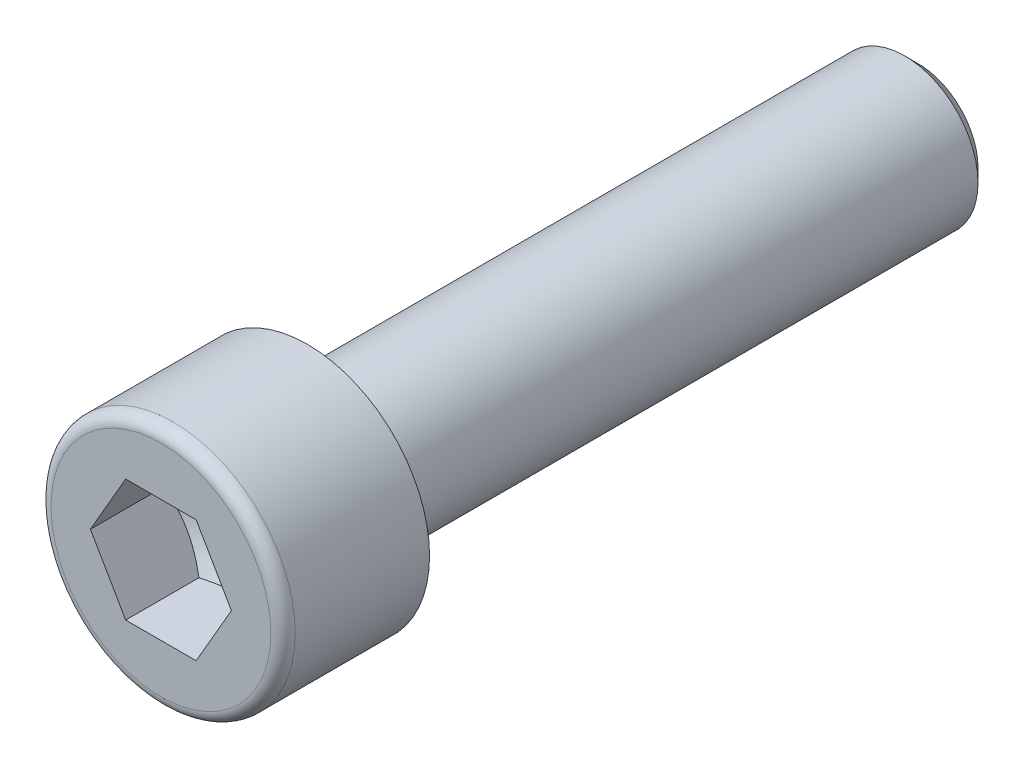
ISO-10303-21;
HEADER;
FILE_DESCRIPTION(('STEP AP214'),'2;1');
FILE_NAME('part.step','',(''),(''),'','','');
FILE_SCHEMA(('AUTOMOTIVE_DESIGN { 1 0 10303 214 1 1 1 1 }'));
ENDSEC;
DATA;
#1=APPLICATION_CONTEXT('core data for automotive mechanical design processes');
#2=APPLICATION_PROTOCOL_DEFINITION('international standard','automotive_design',2000,#1);
#3=PRODUCT_CONTEXT('',#1,'mechanical');
#4=PRODUCT('Part','Part','',(#3));
#5=PRODUCT_RELATED_PRODUCT_CATEGORY('part','',(#4));
#6=PRODUCT_DEFINITION_FORMATION('','',#4);
#7=PRODUCT_DEFINITION_CONTEXT('part definition',#1,'design');
#8=PRODUCT_DEFINITION('design','',#6,#7);
#9=PRODUCT_DEFINITION_SHAPE('','',#8);
#10=(LENGTH_UNIT() NAMED_UNIT(*) SI_UNIT(.MILLI.,.METRE.));
#11=(NAMED_UNIT(*) PLANE_ANGLE_UNIT() SI_UNIT($,.RADIAN.));
#12=(NAMED_UNIT(*) SI_UNIT($,.STERADIAN.) SOLID_ANGLE_UNIT());
#13=UNCERTAINTY_MEASURE_WITH_UNIT(LENGTH_MEASURE(1.E-05),#10,'distance_accuracy_value','');
#14=(GEOMETRIC_REPRESENTATION_CONTEXT(3) GLOBAL_UNCERTAINTY_ASSIGNED_CONTEXT((#13)) GLOBAL_UNIT_ASSIGNED_CONTEXT((#10,
#11,#12)) REPRESENTATION_CONTEXT('',''));
#15=CARTESIAN_POINT('',(0.,0.,0.));
#16=DIRECTION('',(0.,0.,1.));
#17=DIRECTION('',(1.,0.,0.));
#18=AXIS2_PLACEMENT_3D('',#15,#16,#17);
#19=CARTESIAN_POINT('',(0.,0.,6.));
#20=DIRECTION('',(0.,0.,1.));
#21=DIRECTION('',(1.,0.,0.));
#22=AXIS2_PLACEMENT_3D('',#19,#20,#21);
#23=PLANE('',#22);
#24=CARTESIAN_POINT('',(0.,0.,6.));
#25=DIRECTION('',(0.,0.,1.));
#26=DIRECTION('',(1.,0.,0.));
#27=AXIS2_PLACEMENT_3D('',#24,#25,#26);
#28=CIRCLE('',#27,4.5);
#29=CARTESIAN_POINT('',(4.5,0.,6.));
#30=VERTEX_POINT('',#29);
#31=EDGE_CURVE('E11',#30,#30,#28,.T.);
#32=ORIENTED_EDGE('',*,*,#31,.T.);
#33=EDGE_LOOP('',(#32));
#34=FACE_BOUND('',#33,.T.);
#35=DIRECTION('',(1.,0.,0.));
#36=VECTOR('',#35,1.);
#37=CARTESIAN_POINT('',(-1.443375,2.49999883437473,6.));
#38=LINE('',#37,#36);
#39=CARTESIAN_POINT('',(-1.443375,2.49999883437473,6.));
#40=VERTEX_POINT('',#39);
#41=CARTESIAN_POINT('',(1.443375,2.49999883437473,6.));
#42=VERTEX_POINT('',#41);
#43=EDGE_CURVE('E92',#40,#42,#38,.T.);
#44=ORIENTED_EDGE('',*,*,#43,.T.);
#45=DIRECTION('',(0.5,-0.866025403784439,0.));
#46=VECTOR('',#45,1.);
#47=CARTESIAN_POINT('',(1.443375,2.49999883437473,6.));
#48=LINE('',#47,#46);
#49=CARTESIAN_POINT('',(2.88675,0.,6.));
#50=VERTEX_POINT('',#49);
#51=EDGE_CURVE('E31',#42,#50,#48,.T.);
#52=ORIENTED_EDGE('',*,*,#51,.T.);
#53=DIRECTION('',(-0.5,-0.866025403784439,0.));
#54=VECTOR('',#53,1.);
#55=CARTESIAN_POINT('',(2.88675,0.,6.));
#56=LINE('',#55,#54);
#57=CARTESIAN_POINT('',(1.443375,-2.49999883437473,6.));
#58=VERTEX_POINT('',#57);
#59=EDGE_CURVE('E169',#50,#58,#56,.T.);
#60=ORIENTED_EDGE('',*,*,#59,.T.);
#61=DIRECTION('',(-1.,0.,0.));
#62=VECTOR('',#61,1.);
#63=CARTESIAN_POINT('',(1.443375,-2.49999883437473,6.));
#64=LINE('',#63,#62);
#65=CARTESIAN_POINT('',(-1.443375,-2.49999883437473,6.));
#66=VERTEX_POINT('',#65);
#67=EDGE_CURVE('E165',#58,#66,#64,.T.);
#68=ORIENTED_EDGE('',*,*,#67,.T.);
#69=DIRECTION('',(-0.5,0.866025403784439,0.));
#70=VECTOR('',#69,1.);
#71=CARTESIAN_POINT('',(-1.443375,-2.49999883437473,6.));
#72=LINE('',#71,#70);
#73=CARTESIAN_POINT('',(-2.88675,0.,6.));
#74=VERTEX_POINT('',#73);
#75=EDGE_CURVE('E160',#66,#74,#72,.T.);
#76=ORIENTED_EDGE('',*,*,#75,.T.);
#77=DIRECTION('',(0.5,0.866025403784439,0.));
#78=VECTOR('',#77,1.);
#79=CARTESIAN_POINT('',(-2.88675,0.,6.));
#80=LINE('',#79,#78);
#81=EDGE_CURVE('E96',#74,#40,#80,.T.);
#82=ORIENTED_EDGE('',*,*,#81,.T.);
#83=EDGE_LOOP('',(#44,#52,#60,#68,#76,#82));
#84=FACE_BOUND('',#83,.T.);
#85=ADVANCED_FACE('F17',(#34,#84),#23,.T.);
#86=CARTESIAN_POINT('',(0.,0.,5.5));
#87=DIRECTION('',(0.,0.,1.));
#88=DIRECTION('',(1.,0.,0.));
#89=AXIS2_PLACEMENT_3D('',#86,#87,#88);
#90=TOROIDAL_SURFACE('',#89,4.5,0.5);
#91=ORIENTED_EDGE('',*,*,#31,.F.);
#92=EDGE_LOOP('',(#91));
#93=FACE_BOUND('',#92,.T.);
#94=CARTESIAN_POINT('',(0.,0.,5.5));
#95=DIRECTION('',(0.,0.,1.));
#96=DIRECTION('',(1.,0.,0.));
#97=AXIS2_PLACEMENT_3D('',#94,#95,#96);
#98=CIRCLE('',#97,5.);
#99=CARTESIAN_POINT('',(5.,0.,5.5));
#100=VERTEX_POINT('',#99);
#101=EDGE_CURVE('E24',#100,#100,#98,.T.);
#102=ORIENTED_EDGE('',*,*,#101,.T.);
#103=EDGE_LOOP('',(#102));
#104=FACE_BOUND('',#103,.T.);
#105=ADVANCED_FACE('F133',(#93,#104),#90,.T.);
#106=CARTESIAN_POINT('',(0.,0.,6.));
#107=DIRECTION('',(0.,0.,1.));
#108=DIRECTION('',(1.,0.,0.));
#109=AXIS2_PLACEMENT_3D('',#106,#107,#108);
#110=CYLINDRICAL_SURFACE('',#109,5.);
#111=CARTESIAN_POINT('',(0.,0.,0.));
#112=DIRECTION('',(0.,0.,1.));
#113=DIRECTION('',(1.,0.,0.));
#114=AXIS2_PLACEMENT_3D('',#111,#112,#113);
#115=CIRCLE('',#114,5.);
#116=CARTESIAN_POINT('',(5.,0.,0.));
#117=VERTEX_POINT('',#116);
#118=EDGE_CURVE('E128',#117,#117,#115,.T.);
#119=ORIENTED_EDGE('',*,*,#118,.T.);
#120=EDGE_LOOP('',(#119));
#121=FACE_BOUND('',#120,.T.);
#122=ORIENTED_EDGE('',*,*,#101,.F.);
#123=EDGE_LOOP('',(#122));
#124=FACE_BOUND('',#123,.T.);
#125=ADVANCED_FACE('F135',(#121,#124),#110,.T.);
#126=CARTESIAN_POINT('',(0.,5.,0.));
#127=DIRECTION('',(0.,0.,-1.));
#128=DIRECTION('',(-1.,0.,0.));
#129=AXIS2_PLACEMENT_3D('',#126,#127,#128);
#130=PLANE('',#129);
#131=CARTESIAN_POINT('',(0.,0.,0.));
#132=DIRECTION('',(0.,0.,1.));
#133=DIRECTION('',(1.,0.,0.));
#134=AXIS2_PLACEMENT_3D('',#131,#132,#133);
#135=CIRCLE('',#134,3.3);
#136=CARTESIAN_POINT('',(3.3,0.,0.));
#137=VERTEX_POINT('',#136);
#138=EDGE_CURVE('E125',#137,#137,#135,.T.);
#139=ORIENTED_EDGE('',*,*,#138,.T.);
#140=EDGE_LOOP('',(#139));
#141=FACE_BOUND('',#140,.T.);
#142=ORIENTED_EDGE('',*,*,#118,.F.);
#143=EDGE_LOOP('',(#142));
#144=FACE_BOUND('',#143,.T.);
#145=ADVANCED_FACE('F137',(#141,#144),#130,.T.);
#146=CARTESIAN_POINT('',(0.,0.,-0.3));
#147=DIRECTION('',(0.,0.,1.));
#148=DIRECTION('',(1.,0.,0.));
#149=AXIS2_PLACEMENT_3D('',#146,#147,#148);
#150=TOROIDAL_SURFACE('',#149,3.3,0.3);
#151=CARTESIAN_POINT('',(0.,0.,-0.3));
#152=DIRECTION('',(0.,0.,1.));
#153=DIRECTION('',(1.,0.,0.));
#154=AXIS2_PLACEMENT_3D('',#151,#152,#153);
#155=CIRCLE('',#154,3.);
#156=CARTESIAN_POINT('',(3.,0.,-0.3));
#157=VERTEX_POINT('',#156);
#158=EDGE_CURVE('E122',#157,#157,#155,.T.);
#159=ORIENTED_EDGE('',*,*,#158,.T.);
#160=EDGE_LOOP('',(#159));
#161=FACE_BOUND('',#160,.T.);
#162=ORIENTED_EDGE('',*,*,#138,.F.);
#163=EDGE_LOOP('',(#162));
#164=FACE_BOUND('',#163,.T.);
#165=ADVANCED_FACE('F145',(#161,#164),#150,.F.);
#166=CARTESIAN_POINT('',(0.,0.,6.));
#167=DIRECTION('',(0.,0.,1.));
#168=DIRECTION('',(1.,0.,0.));
#169=AXIS2_PLACEMENT_3D('',#166,#167,#168);
#170=CYLINDRICAL_SURFACE('',#169,3.);
#171=CARTESIAN_POINT('',(0.,0.,-0.0625275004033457));
#172=DIRECTION('',(0.,0.,1.));
#173=DIRECTION('',(1.,0.,0.));
#174=AXIS2_PLACEMENT_3D('',#171,#172,#173);
#175=CIRCLE('',#174,3.);
#176=CARTESIAN_POINT('',(3.,0.,-0.0625275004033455));
#177=VERTEX_POINT('',#176);
#178=EDGE_CURVE('E119',#177,#177,#175,.T.);
#179=ORIENTED_EDGE('',*,*,#178,.T.);
#180=EDGE_LOOP('',(#179));
#181=FACE_BOUND('',#180,.T.);
#182=ORIENTED_EDGE('',*,*,#158,.F.);
#183=EDGE_LOOP('',(#182));
#184=FACE_BOUND('',#183,.T.);
#185=ADVANCED_FACE('F317',(#181,#184),#170,.F.);
#186=CARTESIAN_POINT('',(0.,0.,-0.0625275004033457));
#187=DIRECTION('',(0.,0.,1.));
#188=DIRECTION('',(1.,0.,0.));
#189=AXIS2_PLACEMENT_3D('',#186,#187,#188);
#190=CONICAL_SURFACE('',#189,3.,0.523598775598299);
#191=CARTESIAN_POINT('',(0.,0.,-1.));
#192=DIRECTION('',(0.,0.,1.));
#193=DIRECTION('',(1.,0.,0.));
#194=AXIS2_PLACEMENT_3D('',#191,#192,#193);
#195=CIRCLE('',#194,2.45875);
#196=CARTESIAN_POINT('',(2.45875,0.,-1.));
#197=VERTEX_POINT('',#196);
#198=EDGE_CURVE('E116',#197,#197,#195,.T.);
#199=ORIENTED_EDGE('',*,*,#198,.T.);
#200=EDGE_LOOP('',(#199));
#201=FACE_BOUND('',#200,.T.);
#202=ORIENTED_EDGE('',*,*,#178,.F.);
#203=EDGE_LOOP('',(#202));
#204=FACE_BOUND('',#203,.T.);
#205=ADVANCED_FACE('F309',(#201,#204),#190,.T.);
#206=CARTESIAN_POINT('',(0.,2.45875,-1.));
#207=DIRECTION('',(0.,0.,1.));
#208=DIRECTION('',(1.,0.,0.));
#209=AXIS2_PLACEMENT_3D('',#206,#207,#208);
#210=PLANE('',#209);
#211=CARTESIAN_POINT('',(0.,0.,-1.));
#212=DIRECTION('',(0.,0.,1.));
#213=DIRECTION('',(1.,0.,0.));
#214=AXIS2_PLACEMENT_3D('',#211,#212,#213);
#215=CIRCLE('',#214,3.);
#216=CARTESIAN_POINT('',(3.,0.,-1.));
#217=VERTEX_POINT('',#216);
#218=EDGE_CURVE('E113',#217,#217,#215,.T.);
#219=ORIENTED_EDGE('',*,*,#218,.T.);
#220=EDGE_LOOP('',(#219));
#221=FACE_BOUND('',#220,.T.);
#222=ORIENTED_EDGE('',*,*,#198,.F.);
#223=EDGE_LOOP('',(#222));
#224=FACE_BOUND('',#223,.T.);
#225=ADVANCED_FACE('F298',(#221,#224),#210,.T.);
#226=CARTESIAN_POINT('',(0.,0.,6.));
#227=DIRECTION('',(0.,0.,1.));
#228=DIRECTION('',(1.,0.,0.));
#229=AXIS2_PLACEMENT_3D('',#226,#227,#228);
#230=CYLINDRICAL_SURFACE('',#229,3.);
#231=CARTESIAN_POINT('',(0.,0.,-24.45875));
#232=DIRECTION('',(0.,0.,1.));
#233=DIRECTION('',(1.,0.,0.));
#234=AXIS2_PLACEMENT_3D('',#231,#232,#233);
#235=CIRCLE('',#234,3.);
#236=CARTESIAN_POINT('',(3.,0.,-24.45875));
#237=VERTEX_POINT('',#236);
#238=EDGE_CURVE('E110',#237,#237,#235,.T.);
#239=ORIENTED_EDGE('',*,*,#238,.T.);
#240=EDGE_LOOP('',(#239));
#241=FACE_BOUND('',#240,.T.);
#242=ORIENTED_EDGE('',*,*,#218,.F.);
#243=EDGE_LOOP('',(#242));
#244=FACE_BOUND('',#243,.T.);
#245=ADVANCED_FACE('F288',(#241,#244),#230,.T.);
#246=CARTESIAN_POINT('',(0.,0.,-24.45875));
#247=DIRECTION('',(0.,0.,1.));
#248=DIRECTION('',(1.,0.,0.));
#249=AXIS2_PLACEMENT_3D('',#246,#247,#248);
#250=CONICAL_SURFACE('',#249,3.,0.78539816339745);
#251=CARTESIAN_POINT('',(0.,0.,-25.));
#252=DIRECTION('',(0.,0.,1.));
#253=DIRECTION('',(1.,0.,0.));
#254=AXIS2_PLACEMENT_3D('',#251,#252,#253);
#255=CIRCLE('',#254,2.45875);
#256=CARTESIAN_POINT('',(2.45875,0.,-25.));
#257=VERTEX_POINT('',#256);
#258=EDGE_CURVE('E107',#257,#257,#255,.T.);
#259=ORIENTED_EDGE('',*,*,#258,.T.);
#260=EDGE_LOOP('',(#259));
#261=FACE_BOUND('',#260,.T.);
#262=ORIENTED_EDGE('',*,*,#238,.F.);
#263=EDGE_LOOP('',(#262));
#264=FACE_BOUND('',#263,.T.);
#265=ADVANCED_FACE('F281',(#261,#264),#250,.T.);
#266=CARTESIAN_POINT('',(0.,2.45875,-25.));
#267=DIRECTION('',(0.,0.,-1.));
#268=DIRECTION('',(-1.,0.,0.));
#269=AXIS2_PLACEMENT_3D('',#266,#267,#268);
#270=PLANE('',#269);
#271=ORIENTED_EDGE('',*,*,#258,.F.);
#272=EDGE_LOOP('',(#271));
#273=FACE_BOUND('',#272,.T.);
#274=ADVANCED_FACE('F225',(#273),#270,.T.);
#275=CARTESIAN_POINT('',(1.443375,2.49999883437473,1.33333411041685));
#276=DIRECTION('',(-0.866025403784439,-0.5,0.));
#277=DIRECTION('',(-0.5,0.866025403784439,0.));
#278=AXIS2_PLACEMENT_3D('',#275,#276,#277);
#279=PLANE('',#278);
#280=DIRECTION('',(0.,0.,1.));
#281=VECTOR('',#280,1.);
#282=CARTESIAN_POINT('',(2.88675,0.,1.33333411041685));
#283=LINE('',#282,#281);
#284=CARTESIAN_POINT('',(2.88675,0.,3.));
#285=VERTEX_POINT('',#284);
#286=EDGE_CURVE('E105',#285,#50,#283,.T.);
#287=ORIENTED_EDGE('',*,*,#286,.T.);
#288=ORIENTED_EDGE('',*,*,#51,.F.);
#289=DIRECTION('',(0.,0.,1.));
#290=VECTOR('',#289,1.);
#291=CARTESIAN_POINT('',(1.443375,2.49999883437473,1.33333411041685));
#292=LINE('',#291,#290);
#293=CARTESIAN_POINT('',(1.443375,2.49999883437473,3.));
#294=VERTEX_POINT('',#293);
#295=EDGE_CURVE('E86',#294,#42,#292,.T.);
#296=ORIENTED_EDGE('',*,*,#295,.F.);
#297=CARTESIAN_POINT('',(2.88675011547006,-1.99999999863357E-07,3.00000006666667));
#298=CARTESIAN_POINT('',(2.82332252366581,0.109859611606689,2.96336950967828));
#299=CARTESIAN_POINT('',(2.75934742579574,0.22066773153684,2.93005593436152));
#300=CARTESIAN_POINT('',(2.63028954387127,0.444202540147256,2.87190808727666));
#301=CARTESIAN_POINT('',(2.56520446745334,0.556933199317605,2.84709438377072));
#302=CARTESIAN_POINT('',(2.43584088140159,0.780997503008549,2.80847006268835));
#303=CARTESIAN_POINT('',(2.37158227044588,0.892296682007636,2.7944023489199));
#304=CARTESIAN_POINT('',(2.24276284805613,1.11541846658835,2.77761157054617));
#305=CARTESIAN_POINT('',(2.17820250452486,1.22724026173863,2.77487459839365));
#306=CARTESIAN_POINT('',(2.05757841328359,1.43616731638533,2.78058295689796));
#307=CARTESIAN_POINT('',(2.00149656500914,1.53330392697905,2.7876266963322));
#308=CARTESIAN_POINT('',(1.8896982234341,1.72694433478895,2.80994670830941));
#309=CARTESIAN_POINT('',(1.83398211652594,1.82344746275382,2.82523059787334));
#310=CARTESIAN_POINT('',(1.72195345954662,2.01748678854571,2.86343736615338));
#311=CARTESIAN_POINT('',(1.66565508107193,2.11499844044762,2.88652212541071));
#312=CARTESIAN_POINT('',(1.55389777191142,2.3085677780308,2.93891477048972));
#313=CARTESIAN_POINT('',(1.49843741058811,2.40462794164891,2.96821035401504));
#314=CARTESIAN_POINT('',(1.44337488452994,2.49999903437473,3.00000006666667));
#315=B_SPLINE_CURVE_WITH_KNOTS('',3,(#297,#298,#299,#300,#301,#302,#303,#304,#305,#306,#307,
#308,#309,#310,#311,#312,#313,#314),.UNSPECIFIED.,.F.,.F.,(4,2,2,2,2,2,2,2,4),(0.,
0.396269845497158,0.793491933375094,1.18088400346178,1.56780044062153,1.90463400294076,
2.24177946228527,2.58640119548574,2.93034658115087),.UNSPECIFIED.);
#316=EDGE_CURVE('E79',#285,#294,#315,.T.);
#317=ORIENTED_EDGE('',*,*,#316,.F.);
#318=EDGE_LOOP('',(#287,#288,#296,#317));
#319=FACE_BOUND('',#318,.T.);
#320=ADVANCED_FACE('F87',(#319),#279,.T.);
#321=CARTESIAN_POINT('',(2.88675,0.,1.33333411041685));
#322=DIRECTION('',(-0.866025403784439,0.5,0.));
#323=DIRECTION('',(0.5,0.866025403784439,0.));
#324=AXIS2_PLACEMENT_3D('',#321,#322,#323);
#325=PLANE('',#324);
#326=DIRECTION('',(0.,0.,1.));
#327=VECTOR('',#326,1.);
#328=CARTESIAN_POINT('',(1.443375,-2.49999883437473,1.33333411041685));
#329=LINE('',#328,#327);
#330=CARTESIAN_POINT('',(1.443375,-2.49999883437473,3.));
#331=VERTEX_POINT('',#330);
#332=EDGE_CURVE('E103',#331,#58,#329,.T.);
#333=ORIENTED_EDGE('',*,*,#332,.T.);
#334=ORIENTED_EDGE('',*,*,#59,.F.);
#335=ORIENTED_EDGE('',*,*,#286,.F.);
#336=CARTESIAN_POINT('',(1.44337488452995,-2.49999903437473,3.00000006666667));
#337=CARTESIAN_POINT('',(1.50680247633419,-2.39013922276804,2.96336950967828));
#338=CARTESIAN_POINT('',(1.57077757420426,-2.27933110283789,2.93005593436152));
#339=CARTESIAN_POINT('',(1.69983545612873,-2.05579629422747,2.87190808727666));
#340=CARTESIAN_POINT('',(1.76492053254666,-1.94306563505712,2.84709438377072));
#341=CARTESIAN_POINT('',(1.89428411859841,-1.71900133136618,2.80847006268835));
#342=CARTESIAN_POINT('',(1.95854272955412,-1.60770215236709,2.7944023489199));
#343=CARTESIAN_POINT('',(2.08736215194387,-1.38458036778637,2.77761157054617));
#344=CARTESIAN_POINT('',(2.15192249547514,-1.2727585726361,2.77487459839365));
#345=CARTESIAN_POINT('',(2.27254658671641,-1.06383151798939,2.78058295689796));
#346=CARTESIAN_POINT('',(2.32862843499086,-0.966694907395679,2.7876266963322));
#347=CARTESIAN_POINT('',(2.4404267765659,-0.773054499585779,2.8099467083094));
#348=CARTESIAN_POINT('',(2.49614288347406,-0.676551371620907,2.82523059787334));
#349=CARTESIAN_POINT('',(2.60817154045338,-0.48251204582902,2.86343736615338));
#350=CARTESIAN_POINT('',(2.66446991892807,-0.385000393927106,2.88652212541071));
#351=CARTESIAN_POINT('',(2.77622722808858,-0.191431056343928,2.93891477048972));
#352=CARTESIAN_POINT('',(2.83168758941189,-0.0953708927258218,2.96821035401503));
#353=CARTESIAN_POINT('',(2.88675011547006,1.99999999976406E-07,3.00000006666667));
#354=B_SPLINE_CURVE_WITH_KNOTS('',3,(#336,#337,#338,#339,#340,#341,#342,#343,#344,#345,#346,
#347,#348,#349,#350,#351,#352,#353),.UNSPECIFIED.,.F.,.F.,(4,2,2,2,2,2,2,2,4),(0.,
0.396269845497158,0.793491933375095,1.18088400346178,1.56780044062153,1.90463400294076,
2.24177946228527,2.58640119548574,2.93034658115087),.UNSPECIFIED.);
#355=EDGE_CURVE('E83',#331,#285,#354,.T.);
#356=ORIENTED_EDGE('',*,*,#355,.F.);
#357=EDGE_LOOP('',(#333,#334,#335,#356));
#358=FACE_BOUND('',#357,.T.);
#359=ADVANCED_FACE('F216',(#358),#325,.T.);
#360=CARTESIAN_POINT('',(1.443375,-2.49999883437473,1.33333411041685));
#361=DIRECTION('',(0.,1.,0.));
#362=DIRECTION('',(1.,0.,0.));
#363=AXIS2_PLACEMENT_3D('',#360,#361,#362);
#364=PLANE('',#363);
#365=DIRECTION('',(0.,0.,1.));
#366=VECTOR('',#365,1.);
#367=CARTESIAN_POINT('',(-1.443375,-2.49999883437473,1.33333411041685));
#368=LINE('',#367,#366);
#369=CARTESIAN_POINT('',(-1.443375,-2.49999883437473,3.));
#370=VERTEX_POINT('',#369);
#371=EDGE_CURVE('E101',#370,#66,#368,.T.);
#372=ORIENTED_EDGE('',*,*,#371,.T.);
#373=ORIENTED_EDGE('',*,*,#67,.F.);
#374=ORIENTED_EDGE('',*,*,#332,.F.);
#375=CARTESIAN_POINT('',(-3.73786106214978,-2.49999883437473,3.92958778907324));
#376=CARTESIAN_POINT('',(-3.62990250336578,-2.49999883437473,3.87779335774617));
#377=CARTESIAN_POINT('',(-3.52168094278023,-2.49999883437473,3.82653690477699));
#378=CARTESIAN_POINT('',(-3.30457164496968,-2.49999883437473,3.72540514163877));
#379=CARTESIAN_POINT('',(-3.1956837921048,-2.49999883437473,3.67553008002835));
#380=CARTESIAN_POINT('',(-2.97647740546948,-2.49999883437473,3.57718765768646));
#381=CARTESIAN_POINT('',(-2.86615419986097,-2.49999883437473,3.52873067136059));
#382=CARTESIAN_POINT('',(-2.64458202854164,-2.49999883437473,3.43398963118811));
#383=CARTESIAN_POINT('',(-2.5333331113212,-2.49999883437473,3.38770546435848));
#384=CARTESIAN_POINT('',(-2.30680205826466,-2.49999883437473,3.29671007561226));
#385=CARTESIAN_POINT('',(-2.19149052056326,-2.49999883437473,3.25207161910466));
#386=CARTESIAN_POINT('',(-1.95947266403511,-2.49999883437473,3.16650598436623));
#387=CARTESIAN_POINT('',(-1.84276618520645,-2.49999883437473,3.12557923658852));
#388=CARTESIAN_POINT('',(-1.60804233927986,-2.49999883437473,3.04860739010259));
#389=CARTESIAN_POINT('',(-1.49002871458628,-2.49999883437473,3.01255100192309));
#390=CARTESIAN_POINT('',(-1.25231014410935,-2.49999883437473,2.94655294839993));
#391=CARTESIAN_POINT('',(-1.13260562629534,-2.49999883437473,2.91660976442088));
#392=CARTESIAN_POINT('',(-0.891754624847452,-2.49999883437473,2.86443431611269));
#393=CARTESIAN_POINT('',(-0.770611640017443,-2.49999883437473,2.84218621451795));
#394=CARTESIAN_POINT('',(-0.526970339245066,-2.49999883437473,2.80685777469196));
#395=CARTESIAN_POINT('',(-0.404472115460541,-2.49999883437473,2.79377681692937));
#396=CARTESIAN_POINT('',(-0.160266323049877,-2.49999883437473,2.77799632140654));
#397=CARTESIAN_POINT('',(-0.0385668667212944,-2.49999883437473,2.77517427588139));
#398=CARTESIAN_POINT('',(0.204641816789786,-2.49999883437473,2.77983589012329));
#399=CARTESIAN_POINT('',(0.326151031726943,-2.49999883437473,2.78732018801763));
#400=CARTESIAN_POINT('',(0.536550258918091,-2.49999883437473,2.80869871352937));
#401=CARTESIAN_POINT('',(0.62567290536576,-2.49999883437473,2.82040889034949));
#402=CARTESIAN_POINT('',(0.803172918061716,-2.49999883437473,2.84856827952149));
#403=CARTESIAN_POINT('',(0.891550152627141,-2.49999883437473,2.86501831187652));
#404=CARTESIAN_POINT('',(1.15551819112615,-2.49999883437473,2.92060817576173));
#405=CARTESIAN_POINT('',(1.32980784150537,-2.49999883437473,2.96597208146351));
#406=CARTESIAN_POINT('',(1.59042319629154,-2.49999883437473,3.04347409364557));
#407=CARTESIAN_POINT('',(1.67812270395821,-2.49999883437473,3.07124565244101));
#408=CARTESIAN_POINT('',(1.85261386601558,-2.49999883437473,3.12935698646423));
#409=CARTESIAN_POINT('',(1.93940604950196,-2.49999883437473,3.15969515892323));
#410=CARTESIAN_POINT('',(2.11219208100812,-2.49999883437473,3.22250012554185));
#411=CARTESIAN_POINT('',(2.19818607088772,-2.49999883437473,3.25496653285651));
#412=CARTESIAN_POINT('',(2.36949689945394,-2.49999883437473,3.32167630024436));
#413=CARTESIAN_POINT('',(2.45481362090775,-2.49999883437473,3.3559199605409));
#414=CARTESIAN_POINT('',(2.67258663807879,-2.49999883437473,3.44552247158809));
#415=CARTESIAN_POINT('',(2.80460718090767,-2.49999883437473,3.50193902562));
#416=CARTESIAN_POINT('',(3.06745885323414,-2.49999883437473,3.61748625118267));
#417=CARTESIAN_POINT('',(3.19828989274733,-2.49999883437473,3.67661712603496));
#418=CARTESIAN_POINT('',(3.45900849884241,-2.49999883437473,3.79697660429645));
#419=CARTESIAN_POINT('',(3.58889589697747,-2.49999883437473,3.85820557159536));
#420=CARTESIAN_POINT('',(3.84788845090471,-2.49999883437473,3.98229868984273));
#421=CARTESIAN_POINT('',(3.97699358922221,-2.49999883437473,4.04516287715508));
#422=CARTESIAN_POINT('',(4.36366789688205,-2.49999883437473,4.2358316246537));
#423=CARTESIAN_POINT('',(4.62028438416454,-2.49999883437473,4.36556637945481));
#424=CARTESIAN_POINT('',(5.1317603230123,-2.49999883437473,4.62835381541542));
#425=CARTESIAN_POINT('',(5.3866199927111,-2.49999883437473,4.76140607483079));
#426=CARTESIAN_POINT('',(5.87112445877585,-2.49999883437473,5.01714627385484));
#427=CARTESIAN_POINT('',(6.10087872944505,-2.49999883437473,5.13962714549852));
#428=CARTESIAN_POINT('',(6.55964828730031,-2.49999883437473,5.3859833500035));
#429=CARTESIAN_POINT('',(6.78866354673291,-2.49999883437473,5.5098587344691));
#430=CARTESIAN_POINT('',(7.24554286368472,-2.49999883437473,5.75833893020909));
#431=CARTESIAN_POINT('',(7.47340836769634,-2.49999883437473,5.88294108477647));
#432=CARTESIAN_POINT('',(7.92867868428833,-2.49999883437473,6.13295637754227));
#433=CARTESIAN_POINT('',(8.15608352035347,-2.49999883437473,6.25836947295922));
#434=CARTESIAN_POINT('',(8.38332285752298,-2.49999883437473,6.38407980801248));
#435=B_SPLINE_CURVE_WITH_KNOTS('',3,(#375,#376,#377,#378,#379,#380,#381,#382,#383,#384,#385,
#386,#387,#388,#389,#390,#391,#392,#393,#394,#395,#396,#397,#398,#399,#400,#401,#402,#403,#404,
#405,#406,#407,#408,#409,#410,#411,#412,#413,#414,#415,#416,#417,#418,#419,#420,#421,#422,#423,
#424,#425,#426,#427,#428,#429,#430,#431,#432,#433,#434),.UNSPECIFIED.,.F.,.F.,(4,2,2,2,2,2,2,2,
2,2,2,2,2,2,2,2,2,2,2,2,2,2,2,2,2,2,2,2,2,4),(0.,0.359225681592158,0.718515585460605,
1.07998495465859,1.44143550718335,1.81233642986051,2.18328031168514,2.55334902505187,
2.92332569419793,3.29253631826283,3.66172198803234,4.02648423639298,4.39126907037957,
4.66080188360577,4.93038135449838,5.46995360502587,5.74590907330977,6.02169347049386,
6.29742787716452,6.5732090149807,7.00387398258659,7.43457126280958,7.86534362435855,
8.29612557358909,9.15872149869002,10.0212083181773,10.8022890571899,11.583398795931,
12.3625217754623,13.1416039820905),.UNSPECIFIED.);
#436=EDGE_CURVE('E207',#370,#331,#435,.T.);
#437=ORIENTED_EDGE('',*,*,#436,.F.);
#438=EDGE_LOOP('',(#372,#373,#374,#437));
#439=FACE_BOUND('',#438,.T.);
#440=ADVANCED_FACE('F212',(#439),#364,.T.);
#441=CARTESIAN_POINT('',(-1.443375,-2.49999883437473,1.33333411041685));
#442=DIRECTION('',(0.866025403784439,0.5,0.));
#443=DIRECTION('',(0.5,-0.866025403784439,0.));
#444=AXIS2_PLACEMENT_3D('',#441,#442,#443);
#445=PLANE('',#444);
#446=DIRECTION('',(0.,0.,1.));
#447=VECTOR('',#446,1.);
#448=CARTESIAN_POINT('',(-2.88675,0.,1.33333411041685));
#449=LINE('',#448,#447);
#450=CARTESIAN_POINT('',(-2.88675,0.,3.));
#451=VERTEX_POINT('',#450);
#452=EDGE_CURVE('E94',#451,#74,#449,.T.);
#453=ORIENTED_EDGE('',*,*,#452,.T.);
#454=ORIENTED_EDGE('',*,*,#75,.F.);
#455=ORIENTED_EDGE('',*,*,#371,.F.);
#456=CARTESIAN_POINT('',(-2.88675011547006,2.E-07,3.00000006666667));
#457=CARTESIAN_POINT('',(-2.82332252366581,-0.109859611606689,2.96336950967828));
#458=CARTESIAN_POINT('',(-2.75934742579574,-0.220667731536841,2.93005593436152));
#459=CARTESIAN_POINT('',(-2.63028954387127,-0.444202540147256,2.87190808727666));
#460=CARTESIAN_POINT('',(-2.56520446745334,-0.556933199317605,2.84709438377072));
#461=CARTESIAN_POINT('',(-2.43584088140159,-0.780997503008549,2.80847006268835));
#462=CARTESIAN_POINT('',(-2.37158227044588,-0.892296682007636,2.7944023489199));
#463=CARTESIAN_POINT('',(-2.24276284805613,-1.11541846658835,2.77761157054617));
#464=CARTESIAN_POINT('',(-2.17820250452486,-1.22724026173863,2.77487459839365));
#465=CARTESIAN_POINT('',(-2.05757841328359,-1.43616731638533,2.78058295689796));
#466=CARTESIAN_POINT('',(-2.00149656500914,-1.53330392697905,2.7876266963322));
#467=CARTESIAN_POINT('',(-1.8896982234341,-1.72694433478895,2.8099467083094));
#468=CARTESIAN_POINT('',(-1.83398211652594,-1.82344746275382,2.82523059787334));
#469=CARTESIAN_POINT('',(-1.72195345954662,-2.01748678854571,2.86343736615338));
#470=CARTESIAN_POINT('',(-1.66565508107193,-2.11499844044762,2.88652212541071));
#471=CARTESIAN_POINT('',(-1.55389777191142,-2.3085677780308,2.93891477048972));
#472=CARTESIAN_POINT('',(-1.49843741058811,-2.40462794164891,2.96821035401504));
#473=CARTESIAN_POINT('',(-1.44337488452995,-2.49999903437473,3.00000006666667));
#474=B_SPLINE_CURVE_WITH_KNOTS('',3,(#456,#457,#458,#459,#460,#461,#462,#463,#464,#465,#466,
#467,#468,#469,#470,#471,#472,#473),.UNSPECIFIED.,.F.,.F.,(4,2,2,2,2,2,2,2,4),(0.,
0.396269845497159,0.793491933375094,1.18088400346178,1.56780044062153,1.90463400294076,
2.24177946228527,2.58640119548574,2.93034658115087),.UNSPECIFIED.);
#475=EDGE_CURVE('E202',#451,#370,#474,.T.);
#476=ORIENTED_EDGE('',*,*,#475,.F.);
#477=EDGE_LOOP('',(#453,#454,#455,#476));
#478=FACE_BOUND('',#477,.T.);
#479=ADVANCED_FACE('F215',(#478),#445,.T.);
#480=CARTESIAN_POINT('',(-2.88675,0.,1.33333411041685));
#481=DIRECTION('',(0.866025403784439,-0.5,0.));
#482=DIRECTION('',(-0.5,-0.866025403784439,0.));
#483=AXIS2_PLACEMENT_3D('',#480,#481,#482);
#484=PLANE('',#483);
#485=DIRECTION('',(0.,0.,1.));
#486=VECTOR('',#485,1.);
#487=CARTESIAN_POINT('',(-1.443375,2.49999883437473,1.33333411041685));
#488=LINE('',#487,#486);
#489=CARTESIAN_POINT('',(-1.443375,2.49999883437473,3.));
#490=VERTEX_POINT('',#489);
#491=EDGE_CURVE('E91',#490,#40,#488,.T.);
#492=ORIENTED_EDGE('',*,*,#491,.T.);
#493=ORIENTED_EDGE('',*,*,#81,.F.);
#494=ORIENTED_EDGE('',*,*,#452,.F.);
#495=CARTESIAN_POINT('',(-1.44337488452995,2.49999903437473,3.00000006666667));
#496=CARTESIAN_POINT('',(-1.50680247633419,2.39013922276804,2.96336950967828));
#497=CARTESIAN_POINT('',(-1.57077757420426,2.27933110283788,2.93005593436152));
#498=CARTESIAN_POINT('',(-1.69983545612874,2.05579629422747,2.87190808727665));
#499=CARTESIAN_POINT('',(-1.76492053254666,1.94306563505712,2.84709438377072));
#500=CARTESIAN_POINT('',(-1.89428411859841,1.71900133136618,2.80847006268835));
#501=CARTESIAN_POINT('',(-1.95854272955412,1.60770215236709,2.7944023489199));
#502=CARTESIAN_POINT('',(-2.08736215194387,1.38458036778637,2.77761157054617));
#503=CARTESIAN_POINT('',(-2.15192249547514,1.2727585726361,2.77487459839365));
#504=CARTESIAN_POINT('',(-2.27254658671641,1.06383151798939,2.78058295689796));
#505=CARTESIAN_POINT('',(-2.32862843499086,0.966694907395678,2.7876266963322));
#506=CARTESIAN_POINT('',(-2.4404267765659,0.773054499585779,2.8099467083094));
#507=CARTESIAN_POINT('',(-2.49614288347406,0.676551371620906,2.82523059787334));
#508=CARTESIAN_POINT('',(-2.60817154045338,0.48251204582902,2.86343736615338));
#509=CARTESIAN_POINT('',(-2.66446991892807,0.385000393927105,2.88652212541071));
#510=CARTESIAN_POINT('',(-2.77622722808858,0.191431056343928,2.93891477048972));
#511=CARTESIAN_POINT('',(-2.83168758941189,0.0953708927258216,2.96821035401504));
#512=CARTESIAN_POINT('',(-2.88675011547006,-2.00000000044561E-07,3.00000006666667));
#513=B_SPLINE_CURVE_WITH_KNOTS('',3,(#495,#496,#497,#498,#499,#500,#501,#502,#503,#504,#505,
#506,#507,#508,#509,#510,#511,#512),.UNSPECIFIED.,.F.,.F.,(4,2,2,2,2,2,2,2,4),(0.,
0.396269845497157,0.793491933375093,1.18088400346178,1.56780044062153,1.90463400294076,
2.24177946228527,2.58640119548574,2.93034658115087),.UNSPECIFIED.);
#514=EDGE_CURVE('E39',#490,#451,#513,.T.);
#515=ORIENTED_EDGE('',*,*,#514,.F.);
#516=EDGE_LOOP('',(#492,#493,#494,#515));
#517=FACE_BOUND('',#516,.T.);
#518=ADVANCED_FACE('F159',(#517),#484,.T.);
#519=CARTESIAN_POINT('',(-1.443375,2.49999883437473,1.33333411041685));
#520=DIRECTION('',(0.,-1.,0.));
#521=DIRECTION('',(-1.,0.,0.));
#522=AXIS2_PLACEMENT_3D('',#519,#520,#521);
#523=PLANE('',#522);
#524=ORIENTED_EDGE('',*,*,#295,.T.);
#525=ORIENTED_EDGE('',*,*,#43,.F.);
#526=ORIENTED_EDGE('',*,*,#491,.F.);
#527=CARTESIAN_POINT('',(-3.73786106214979,2.49999883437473,3.92958778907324));
#528=CARTESIAN_POINT('',(-3.62990250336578,2.49999883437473,3.87779335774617));
#529=CARTESIAN_POINT('',(-3.52168094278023,2.49999883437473,3.82653690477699));
#530=CARTESIAN_POINT('',(-3.30457164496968,2.49999883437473,3.72540514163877));
#531=CARTESIAN_POINT('',(-3.1956837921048,2.49999883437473,3.67553008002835));
#532=CARTESIAN_POINT('',(-2.97647740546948,2.49999883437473,3.57718765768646));
#533=CARTESIAN_POINT('',(-2.86615419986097,2.49999883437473,3.5287306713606));
#534=CARTESIAN_POINT('',(-2.64458202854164,2.49999883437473,3.43398963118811));
#535=CARTESIAN_POINT('',(-2.53333311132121,2.49999883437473,3.38770546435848));
#536=CARTESIAN_POINT('',(-2.30680205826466,2.49999883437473,3.29671007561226));
#537=CARTESIAN_POINT('',(-2.19149052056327,2.49999883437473,3.25207161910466));
#538=CARTESIAN_POINT('',(-1.95947266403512,2.49999883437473,3.16650598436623));
#539=CARTESIAN_POINT('',(-1.84276618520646,2.49999883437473,3.12557923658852));
#540=CARTESIAN_POINT('',(-1.60804233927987,2.49999883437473,3.04860739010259));
#541=CARTESIAN_POINT('',(-1.49002871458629,2.49999883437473,3.01255100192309));
#542=CARTESIAN_POINT('',(-1.25231014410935,2.49999883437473,2.94655294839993));
#543=CARTESIAN_POINT('',(-1.13260562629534,2.49999883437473,2.91660976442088));
#544=CARTESIAN_POINT('',(-0.891754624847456,2.49999883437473,2.86443431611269));
#545=CARTESIAN_POINT('',(-0.770611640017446,2.49999883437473,2.84218621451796));
#546=CARTESIAN_POINT('',(-0.526970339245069,2.49999883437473,2.80685777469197));
#547=CARTESIAN_POINT('',(-0.404472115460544,2.49999883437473,2.79377681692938));
#548=CARTESIAN_POINT('',(-0.160266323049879,2.49999883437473,2.77799632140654));
#549=CARTESIAN_POINT('',(-0.0385668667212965,2.49999883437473,2.77517427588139));
#550=CARTESIAN_POINT('',(0.204641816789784,2.49999883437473,2.77983589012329));
#551=CARTESIAN_POINT('',(0.326151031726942,2.49999883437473,2.78732018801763));
#552=CARTESIAN_POINT('',(0.536550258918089,2.49999883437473,2.80869871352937));
#553=CARTESIAN_POINT('',(0.625672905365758,2.49999883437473,2.82040889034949));
#554=CARTESIAN_POINT('',(0.803172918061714,2.49999883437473,2.84856827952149));
#555=CARTESIAN_POINT('',(0.891550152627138,2.49999883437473,2.86501831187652));
#556=CARTESIAN_POINT('',(1.15551819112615,2.49999883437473,2.92060817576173));
#557=CARTESIAN_POINT('',(1.32980784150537,2.49999883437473,2.96597208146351));
#558=CARTESIAN_POINT('',(1.59042319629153,2.49999883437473,3.04347409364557));
#559=CARTESIAN_POINT('',(1.67812270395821,2.49999883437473,3.07124565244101));
#560=CARTESIAN_POINT('',(1.85261386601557,2.49999883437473,3.12935698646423));
#561=CARTESIAN_POINT('',(1.93940604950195,2.49999883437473,3.15969515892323));
#562=CARTESIAN_POINT('',(2.11219208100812,2.49999883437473,3.22250012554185));
#563=CARTESIAN_POINT('',(2.19818607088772,2.49999883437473,3.25496653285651));
#564=CARTESIAN_POINT('',(2.36949689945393,2.49999883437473,3.32167630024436));
#565=CARTESIAN_POINT('',(2.45481362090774,2.49999883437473,3.3559199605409));
#566=CARTESIAN_POINT('',(2.67258663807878,2.49999883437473,3.44552247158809));
#567=CARTESIAN_POINT('',(2.80460718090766,2.49999883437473,3.50193902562));
#568=CARTESIAN_POINT('',(3.06745885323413,2.49999883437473,3.61748625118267));
#569=CARTESIAN_POINT('',(3.19828989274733,2.49999883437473,3.67661712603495));
#570=CARTESIAN_POINT('',(3.45900849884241,2.49999883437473,3.79697660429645));
#571=CARTESIAN_POINT('',(3.58889589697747,2.49999883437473,3.85820557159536));
#572=CARTESIAN_POINT('',(3.84788845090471,2.49999883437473,3.98229868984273));
#573=CARTESIAN_POINT('',(3.97699358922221,2.49999883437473,4.04516287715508));
#574=CARTESIAN_POINT('',(4.36366789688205,2.49999883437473,4.2358316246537));
#575=CARTESIAN_POINT('',(4.62028438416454,2.49999883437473,4.36556637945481));
#576=CARTESIAN_POINT('',(5.1317603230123,2.49999883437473,4.62835381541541));
#577=CARTESIAN_POINT('',(5.38661999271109,2.49999883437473,4.76140607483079));
#578=CARTESIAN_POINT('',(5.87112445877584,2.49999883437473,5.01714627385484));
#579=CARTESIAN_POINT('',(6.10087872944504,2.49999883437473,5.13962714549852));
#580=CARTESIAN_POINT('',(6.5596482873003,2.49999883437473,5.3859833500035));
#581=CARTESIAN_POINT('',(6.7886635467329,2.49999883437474,5.5098587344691));
#582=CARTESIAN_POINT('',(7.24554286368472,2.49999883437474,5.75833893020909));
#583=CARTESIAN_POINT('',(7.47340836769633,2.49999883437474,5.88294108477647));
#584=CARTESIAN_POINT('',(7.92867868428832,2.49999883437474,6.13295637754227));
#585=CARTESIAN_POINT('',(8.15608352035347,2.49999883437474,6.25836947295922));
#586=CARTESIAN_POINT('',(8.38332285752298,2.49999883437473,6.38407980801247));
#587=B_SPLINE_CURVE_WITH_KNOTS('',3,(#527,#528,#529,#530,#531,#532,#533,#534,#535,#536,#537,
#538,#539,#540,#541,#542,#543,#544,#545,#546,#547,#548,#549,#550,#551,#552,#553,#554,#555,#556,
#557,#558,#559,#560,#561,#562,#563,#564,#565,#566,#567,#568,#569,#570,#571,#572,#573,#574,#575,
#576,#577,#578,#579,#580,#581,#582,#583,#584,#585,#586),.UNSPECIFIED.,.F.,.F.,(4,2,2,2,2,2,2,2,
2,2,2,2,2,2,2,2,2,2,2,2,2,2,2,2,2,2,2,2,2,4),(0.,0.359225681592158,0.718515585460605,
1.07998495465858,1.44143550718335,1.81233642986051,2.18328031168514,2.55334902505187,
2.92332569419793,3.29253631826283,3.66172198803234,4.02648423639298,4.39126907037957,
4.66080188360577,4.93038135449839,5.46995360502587,5.74590907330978,6.02169347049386,
6.29742787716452,6.5732090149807,7.00387398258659,7.43457126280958,7.86534362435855,
8.29612557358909,9.15872149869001,10.0212083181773,10.8022890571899,11.583398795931,
12.3625217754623,13.1416039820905),.UNSPECIFIED.);
#588=EDGE_CURVE('E80',#294,#490,#587,.F.);
#589=ORIENTED_EDGE('',*,*,#588,.F.);
#590=EDGE_LOOP('',(#524,#525,#526,#589));
#591=FACE_BOUND('',#590,.T.);
#592=ADVANCED_FACE('F75',(#591),#523,.T.);
#593=CARTESIAN_POINT('',(0.,0.,1.33333411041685));
#594=DIRECTION('',(0.,0.,1.));
#595=DIRECTION('',(1.,0.,0.));
#596=AXIS2_PLACEMENT_3D('',#593,#594,#595);
#597=CONICAL_SURFACE('',#596,0.,1.0471975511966);
#598=CARTESIAN_POINT('',(0.,0.,1.33333411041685));
#599=VERTEX_POINT('',#598);
#600=VERTEX_LOOP('',#599);
#601=FACE_BOUND('',#600,.T.);
#602=ORIENTED_EDGE('',*,*,#316,.T.);
#603=ORIENTED_EDGE('',*,*,#588,.T.);
#604=ORIENTED_EDGE('',*,*,#514,.T.);
#605=ORIENTED_EDGE('',*,*,#475,.T.);
#606=ORIENTED_EDGE('',*,*,#436,.T.);
#607=ORIENTED_EDGE('',*,*,#355,.T.);
#608=EDGE_LOOP('',(#602,#603,#604,#605,#606,#607));
#609=FACE_BOUND('',#608,.T.);
#610=ADVANCED_FACE('F72',(#601,#609),#597,.F.);
#611=CLOSED_SHELL('',(#85,#105,#125,#145,#165,#185,#205,#225,#245,#265,#274,#320,#359,#440,#479,
#518,#592,#610));
#612=MANIFOLD_SOLID_BREP('B1',#611);
#613=ADVANCED_BREP_SHAPE_REPRESENTATION('',(#18,#612),#14);
#614=SHAPE_DEFINITION_REPRESENTATION(#9,#613);
ENDSEC;
END-ISO-10303-21;
